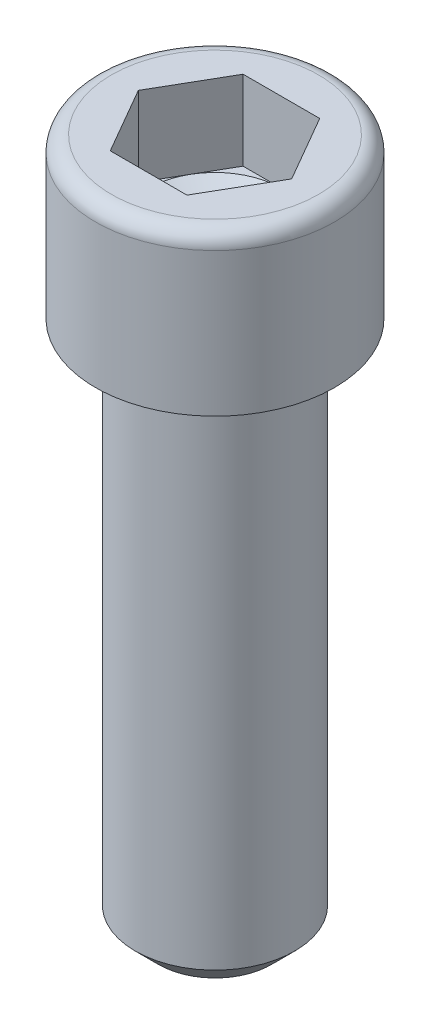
ISO-10303-21;
HEADER;
FILE_DESCRIPTION(('STEP AP214'),'2;1');
FILE_NAME('part.step','',(''),(''),'','','');
FILE_SCHEMA(('AUTOMOTIVE_DESIGN { 1 0 10303 214 1 1 1 1 }'));
ENDSEC;
DATA;
#1=APPLICATION_CONTEXT('core data for automotive mechanical design processes');
#2=APPLICATION_PROTOCOL_DEFINITION('international standard','automotive_design',2000,#1);
#3=PRODUCT_CONTEXT('',#1,'mechanical');
#4=PRODUCT('Part','Part','',(#3));
#5=PRODUCT_RELATED_PRODUCT_CATEGORY('part','',(#4));
#6=PRODUCT_DEFINITION_FORMATION('','',#4);
#7=PRODUCT_DEFINITION_CONTEXT('part definition',#1,'design');
#8=PRODUCT_DEFINITION('design','',#6,#7);
#9=PRODUCT_DEFINITION_SHAPE('','',#8);
#10=(LENGTH_UNIT() NAMED_UNIT(*) SI_UNIT(.MILLI.,.METRE.));
#11=(NAMED_UNIT(*) PLANE_ANGLE_UNIT() SI_UNIT($,.RADIAN.));
#12=(NAMED_UNIT(*) SI_UNIT($,.STERADIAN.) SOLID_ANGLE_UNIT());
#13=UNCERTAINTY_MEASURE_WITH_UNIT(LENGTH_MEASURE(1.E-05),#10,'distance_accuracy_value','');
#14=(GEOMETRIC_REPRESENTATION_CONTEXT(3) GLOBAL_UNCERTAINTY_ASSIGNED_CONTEXT((#13)) GLOBAL_UNIT_ASSIGNED_CONTEXT((#10,
#11,#12)) REPRESENTATION_CONTEXT('',''));
#15=CARTESIAN_POINT('',(0.,0.,0.));
#16=DIRECTION('',(0.,0.,1.));
#17=DIRECTION('',(1.,0.,0.));
#18=AXIS2_PLACEMENT_3D('',#15,#16,#17);
#19=CARTESIAN_POINT('',(5.,12.,0.));
#20=DIRECTION('',(0.,-1.,0.));
#21=DIRECTION('',(1.,0.,0.));
#22=AXIS2_PLACEMENT_3D('',#19,#20,#21);
#23=PLANE('',#22);
#24=CARTESIAN_POINT('',(0.,12.,0.));
#25=DIRECTION('',(0.,1.,0.));
#26=DIRECTION('',(-1.,0.,0.));
#27=AXIS2_PLACEMENT_3D('',#24,#25,#26);
#28=CIRCLE('',#27,7.8);
#29=CARTESIAN_POINT('',(-7.8,12.,0.));
#30=VERTEX_POINT('',#29);
#31=EDGE_CURVE('E139',#30,#30,#28,.T.);
#32=ORIENTED_EDGE('',*,*,#31,.T.);
#33=EDGE_LOOP('',(#32));
#34=FACE_BOUND('',#33,.T.);
#35=DIRECTION('',(0.499999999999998,0.,0.86602540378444));
#36=VECTOR('',#35,1.);
#37=CARTESIAN_POINT('',(2.88675134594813,12.,-5.));
#38=LINE('',#37,#36);
#39=CARTESIAN_POINT('',(2.88675134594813,12.,-5.));
#40=VERTEX_POINT('',#39);
#41=CARTESIAN_POINT('',(5.77350269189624,12.,0.));
#42=VERTEX_POINT('',#41);
#43=EDGE_CURVE('E371',#40,#42,#38,.T.);
#44=ORIENTED_EDGE('',*,*,#43,.T.);
#45=DIRECTION('',(-0.499999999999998,0.,0.86602540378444));
#46=VECTOR('',#45,1.);
#47=CARTESIAN_POINT('',(2.88675134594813,12.,5.));
#48=LINE('',#47,#46);
#49=CARTESIAN_POINT('',(2.88675134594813,12.,5.));
#50=VERTEX_POINT('',#49);
#51=EDGE_CURVE('E374',#42,#50,#48,.T.);
#52=ORIENTED_EDGE('',*,*,#51,.T.);
#53=DIRECTION('',(-1.,0.,0.));
#54=VECTOR('',#53,1.);
#55=CARTESIAN_POINT('',(2.88675134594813,12.,5.));
#56=LINE('',#55,#54);
#57=CARTESIAN_POINT('',(-2.88675134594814,12.,5.));
#58=VERTEX_POINT('',#57);
#59=EDGE_CURVE('E377',#50,#58,#56,.T.);
#60=ORIENTED_EDGE('',*,*,#59,.T.);
#61=DIRECTION('',(-0.499999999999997,0.,-0.86602540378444));
#62=VECTOR('',#61,1.);
#63=CARTESIAN_POINT('',(-2.88675134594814,12.,5.));
#64=LINE('',#63,#62);
#65=CARTESIAN_POINT('',(-5.77350269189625,12.,0.));
#66=VERTEX_POINT('',#65);
#67=EDGE_CURVE('E116',#58,#66,#64,.T.);
#68=ORIENTED_EDGE('',*,*,#67,.T.);
#69=DIRECTION('',(0.499999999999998,0.,-0.86602540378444));
#70=VECTOR('',#69,1.);
#71=CARTESIAN_POINT('',(-2.88675134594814,12.,-5.));
#72=LINE('',#71,#70);
#73=CARTESIAN_POINT('',(-2.88675134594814,12.,-5.));
#74=VERTEX_POINT('',#73);
#75=EDGE_CURVE('E368',#66,#74,#72,.T.);
#76=ORIENTED_EDGE('',*,*,#75,.T.);
#77=DIRECTION('',(1.,0.,0.));
#78=VECTOR('',#77,1.);
#79=CARTESIAN_POINT('',(2.88675134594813,12.,-5.));
#80=LINE('',#79,#78);
#81=EDGE_CURVE('E127',#74,#40,#80,.T.);
#82=ORIENTED_EDGE('',*,*,#81,.T.);
#83=EDGE_LOOP('',(#44,#52,#60,#68,#76,#82));
#84=FACE_BOUND('',#83,.T.);
#85=ADVANCED_FACE('F33',(#34,#84),#23,.F.);
#86=CARTESIAN_POINT('',(0.,-40.,0.));
#87=DIRECTION('',(0.,1.,0.));
#88=DIRECTION('',(0.,0.,1.));
#89=AXIS2_PLACEMENT_3D('',#86,#87,#88);
#90=CYLINDRICAL_SURFACE('',#89,6.);
#91=CARTESIAN_POINT('',(0.,-38.25,0.));
#92=DIRECTION('',(0.,1.,0.));
#93=DIRECTION('',(0.,0.,1.));
#94=AXIS2_PLACEMENT_3D('',#91,#92,#93);
#95=CIRCLE('',#94,6.);
#96=CARTESIAN_POINT('',(0.,-38.25,6.));
#97=VERTEX_POINT('',#96);
#98=EDGE_CURVE('E41',#97,#97,#95,.T.);
#99=ORIENTED_EDGE('',*,*,#98,.T.);
#100=EDGE_LOOP('',(#99));
#101=FACE_BOUND('',#100,.T.);
#102=CARTESIAN_POINT('',(0.,0.,0.));
#103=DIRECTION('',(0.,1.,0.));
#104=DIRECTION('',(0.,0.,1.));
#105=AXIS2_PLACEMENT_3D('',#102,#103,#104);
#106=CIRCLE('',#105,6.);
#107=CARTESIAN_POINT('',(0.,0.,6.));
#108=VERTEX_POINT('',#107);
#109=EDGE_CURVE('E149',#108,#108,#106,.T.);
#110=ORIENTED_EDGE('',*,*,#109,.F.);
#111=EDGE_LOOP('',(#110));
#112=FACE_BOUND('',#111,.T.);
#113=ADVANCED_FACE('F154',(#101,#112),#90,.T.);
#114=CARTESIAN_POINT('',(0.,-40.,0.));
#115=DIRECTION('',(0.,1.,0.));
#116=DIRECTION('',(0.,0.,1.));
#117=AXIS2_PLACEMENT_3D('',#114,#115,#116);
#118=PLANE('',#117);
#119=CARTESIAN_POINT('',(0.,-40.,0.));
#120=DIRECTION('',(0.,1.,0.));
#121=DIRECTION('',(0.,0.,1.));
#122=AXIS2_PLACEMENT_3D('',#119,#120,#121);
#123=CIRCLE('',#122,4.24999999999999);
#124=CARTESIAN_POINT('',(0.,-40.,4.24999999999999));
#125=VERTEX_POINT('',#124);
#126=EDGE_CURVE('E11',#125,#125,#123,.F.);
#127=ORIENTED_EDGE('',*,*,#126,.T.);
#128=EDGE_LOOP('',(#127));
#129=FACE_BOUND('',#128,.T.);
#130=ADVANCED_FACE('F159',(#129),#118,.F.);
#131=CARTESIAN_POINT('',(0.,-38.25,0.));
#132=DIRECTION('',(0.,1.,0.));
#133=DIRECTION('',(0.,0.,1.));
#134=AXIS2_PLACEMENT_3D('',#131,#132,#133);
#135=CONICAL_SURFACE('',#134,6.,0.78539816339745);
#136=CARTESIAN_POINT('',(0.,-40.,4.24999999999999));
#137=CARTESIAN_POINT('',(0.,-39.9817708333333,4.26822916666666));
#138=CARTESIAN_POINT('',(0.,-39.9635416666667,4.28645833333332));
#139=CARTESIAN_POINT('',(0.,-39.9270833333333,4.32291666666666));
#140=CARTESIAN_POINT('',(0.,-39.9088541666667,4.34114583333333));
#141=CARTESIAN_POINT('',(0.,-39.8723958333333,4.37760416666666));
#142=CARTESIAN_POINT('',(0.,-39.8541666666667,4.39583333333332));
#143=CARTESIAN_POINT('',(0.,-39.8177083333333,4.43229166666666));
#144=CARTESIAN_POINT('',(0.,-39.7994791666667,4.45052083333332));
#145=CARTESIAN_POINT('',(0.,-39.7630208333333,4.48697916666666));
#146=CARTESIAN_POINT('',(0.,-39.7447916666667,4.50520833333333));
#147=CARTESIAN_POINT('',(0.,-39.7083333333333,4.54166666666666));
#148=CARTESIAN_POINT('',(0.,-39.6901041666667,4.55989583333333));
#149=CARTESIAN_POINT('',(0.,-39.6536458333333,4.59635416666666));
#150=CARTESIAN_POINT('',(0.,-39.6354166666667,4.61458333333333));
#151=CARTESIAN_POINT('',(0.,-39.5989583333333,4.65104166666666));
#152=CARTESIAN_POINT('',(0.,-39.5807291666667,4.66927083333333));
#153=CARTESIAN_POINT('',(0.,-39.5442708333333,4.70572916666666));
#154=CARTESIAN_POINT('',(0.,-39.5260416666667,4.72395833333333));
#155=CARTESIAN_POINT('',(0.,-39.4895833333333,4.76041666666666));
#156=CARTESIAN_POINT('',(0.,-39.4713541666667,4.77864583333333));
#157=CARTESIAN_POINT('',(0.,-39.4348958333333,4.81510416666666));
#158=CARTESIAN_POINT('',(0.,-39.4166666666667,4.83333333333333));
#159=CARTESIAN_POINT('',(0.,-39.3802083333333,4.86979166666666));
#160=CARTESIAN_POINT('',(0.,-39.3619791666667,4.88802083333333));
#161=CARTESIAN_POINT('',(0.,-39.3255208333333,4.92447916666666));
#162=CARTESIAN_POINT('',(0.,-39.3072916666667,4.94270833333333));
#163=CARTESIAN_POINT('',(0.,-39.2708333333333,4.97916666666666));
#164=CARTESIAN_POINT('',(0.,-39.2526041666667,4.99739583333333));
#165=CARTESIAN_POINT('',(0.,-39.2161458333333,5.03385416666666));
#166=CARTESIAN_POINT('',(0.,-39.1979166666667,5.05208333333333));
#167=CARTESIAN_POINT('',(0.,-39.1614583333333,5.08854166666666));
#168=CARTESIAN_POINT('',(0.,-39.1432291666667,5.10677083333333));
#169=CARTESIAN_POINT('',(0.,-39.1067708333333,5.14322916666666));
#170=CARTESIAN_POINT('',(0.,-39.0885416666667,5.16145833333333));
#171=CARTESIAN_POINT('',(0.,-39.0520833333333,5.19791666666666));
#172=CARTESIAN_POINT('',(0.,-39.0338541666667,5.21614583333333));
#173=CARTESIAN_POINT('',(0.,-38.9973958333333,5.25260416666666));
#174=CARTESIAN_POINT('',(0.,-38.9791666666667,5.27083333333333));
#175=CARTESIAN_POINT('',(0.,-38.9427083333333,5.30729166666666));
#176=CARTESIAN_POINT('',(0.,-38.9244791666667,5.32552083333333));
#177=CARTESIAN_POINT('',(0.,-38.8880208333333,5.36197916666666));
#178=CARTESIAN_POINT('',(0.,-38.8697916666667,5.38020833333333));
#179=CARTESIAN_POINT('',(0.,-38.8333333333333,5.41666666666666));
#180=CARTESIAN_POINT('',(0.,-38.8151041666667,5.43489583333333));
#181=CARTESIAN_POINT('',(0.,-38.7786458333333,5.47135416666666));
#182=CARTESIAN_POINT('',(0.,-38.7604166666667,5.48958333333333));
#183=CARTESIAN_POINT('',(0.,-38.7239583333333,5.52604166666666));
#184=CARTESIAN_POINT('',(0.,-38.7057291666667,5.54427083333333));
#185=CARTESIAN_POINT('',(0.,-38.6692708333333,5.58072916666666));
#186=CARTESIAN_POINT('',(0.,-38.6510416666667,5.59895833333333));
#187=CARTESIAN_POINT('',(0.,-38.6145833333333,5.63541666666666));
#188=CARTESIAN_POINT('',(0.,-38.5963541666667,5.65364583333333));
#189=CARTESIAN_POINT('',(0.,-38.5598958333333,5.69010416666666));
#190=CARTESIAN_POINT('',(0.,-38.5416666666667,5.70833333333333));
#191=CARTESIAN_POINT('',(0.,-38.5052083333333,5.74479166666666));
#192=CARTESIAN_POINT('',(0.,-38.4869791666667,5.76302083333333));
#193=CARTESIAN_POINT('',(0.,-38.4505208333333,5.79947916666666));
#194=CARTESIAN_POINT('',(0.,-38.4322916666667,5.81770833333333));
#195=CARTESIAN_POINT('',(0.,-38.3958333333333,5.85416666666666));
#196=CARTESIAN_POINT('',(0.,-38.3776041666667,5.87239583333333));
#197=CARTESIAN_POINT('',(0.,-38.3411458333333,5.90885416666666));
#198=CARTESIAN_POINT('',(0.,-38.3229166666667,5.92708333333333));
#199=CARTESIAN_POINT('',(0.,-38.2864583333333,5.96354166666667));
#200=CARTESIAN_POINT('',(0.,-38.2682291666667,5.98177083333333));
#201=CARTESIAN_POINT('',(0.,-38.25,6.));
#202=B_SPLINE_CURVE_WITH_KNOTS('',3,(#136,#137,#138,#139,#140,#141,#142,#143,#144,#145,#146,
#147,#148,#149,#150,#151,#152,#153,#154,#155,#156,#157,#158,#159,#160,#161,#162,#163,#164,#165,
#166,#167,#168,#169,#170,#171,#172,#173,#174,#175,#176,#177,#178,#179,#180,#181,#182,#183,#184,
#185,#186,#187,#188,#189,#190,#191,#192,#193,#194,#195,#196,#197,#198,#199,#200,#201),
.UNSPECIFIED.,.F.,.F.,(4,2,2,2,2,2,2,2,2,2,2,2,2,2,2,2,2,2,2,2,2,2,2,2,2,2,2,2,2,2,2,2,4),(0.,
0.0773398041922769,0.154679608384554,0.232019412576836,0.309359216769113,0.38669902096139,
0.464038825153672,0.541378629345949,0.618718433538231,0.696058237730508,0.773398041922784,
0.850737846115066,0.928077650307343,1.00541745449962,1.0827572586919,1.16009706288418,
1.23743686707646,1.31477667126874,1.39211647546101,1.4694562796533,1.54679608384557,
1.62413588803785,1.70147569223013,1.77881549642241,1.85615530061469,1.93349510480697,
2.01083490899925,2.08817471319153,2.16551451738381,2.24285432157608,2.32019412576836,
2.39753392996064,2.47487373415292),.UNSPECIFIED.);
#203=EDGE_CURVE('BSEAM35',#125,#97,#202,.T.);
#204=ORIENTED_EDGE('',*,*,#126,.F.);
#205=ORIENTED_EDGE('',*,*,#98,.F.);
#206=ORIENTED_EDGE('',*,*,#203,.T.);
#207=ORIENTED_EDGE('',*,*,#203,.F.);
#208=EDGE_LOOP('',(#204,#206,#205,#207));
#209=FACE_BOUND('',#208,.T.);
#210=ADVANCED_FACE('F35',(#209),#135,.T.);
#211=CARTESIAN_POINT('',(0.,0.,0.));
#212=DIRECTION('',(0.,1.,0.));
#213=DIRECTION('',(-1.,0.,0.));
#214=AXIS2_PLACEMENT_3D('',#211,#212,#213);
#215=PLANE('',#214);
#216=ORIENTED_EDGE('',*,*,#109,.T.);
#217=EDGE_LOOP('',(#216));
#218=FACE_BOUND('',#217,.T.);
#219=CARTESIAN_POINT('',(0.,0.,0.));
#220=DIRECTION('',(0.,1.,0.));
#221=DIRECTION('',(-1.,0.,0.));
#222=AXIS2_PLACEMENT_3D('',#219,#220,#221);
#223=CIRCLE('',#222,9.);
#224=CARTESIAN_POINT('',(-9.,0.,0.));
#225=VERTEX_POINT('',#224);
#226=EDGE_CURVE('E146',#225,#225,#223,.T.);
#227=ORIENTED_EDGE('',*,*,#226,.F.);
#228=EDGE_LOOP('',(#227));
#229=FACE_BOUND('',#228,.T.);
#230=ADVANCED_FACE('F158',(#218,#229),#215,.F.);
#231=CARTESIAN_POINT('',(0.,12.,0.));
#232=DIRECTION('',(0.,1.,0.));
#233=DIRECTION('',(-1.,0.,0.));
#234=AXIS2_PLACEMENT_3D('',#231,#232,#233);
#235=CYLINDRICAL_SURFACE('',#234,9.);
#236=CARTESIAN_POINT('',(0.,10.8,0.));
#237=DIRECTION('',(0.,1.,0.));
#238=DIRECTION('',(-1.,0.,0.));
#239=AXIS2_PLACEMENT_3D('',#236,#237,#238);
#240=CIRCLE('',#239,9.);
#241=CARTESIAN_POINT('',(-9.,10.8,0.));
#242=VERTEX_POINT('',#241);
#243=EDGE_CURVE('E143',#242,#242,#240,.T.);
#244=ORIENTED_EDGE('',*,*,#243,.F.);
#245=EDGE_LOOP('',(#244));
#246=FACE_BOUND('',#245,.T.);
#247=ORIENTED_EDGE('',*,*,#226,.T.);
#248=EDGE_LOOP('',(#247));
#249=FACE_BOUND('',#248,.T.);
#250=ADVANCED_FACE('F165',(#246,#249),#235,.T.);
#251=CARTESIAN_POINT('',(0.,10.8,0.));
#252=DIRECTION('',(0.,1.,0.));
#253=DIRECTION('',(-1.,0.,0.));
#254=AXIS2_PLACEMENT_3D('',#251,#252,#253);
#255=TOROIDAL_SURFACE('',#254,7.8,1.2);
#256=ORIENTED_EDGE('',*,*,#31,.F.);
#257=EDGE_LOOP('',(#256));
#258=FACE_BOUND('',#257,.T.);
#259=ORIENTED_EDGE('',*,*,#243,.T.);
#260=EDGE_LOOP('',(#259));
#261=FACE_BOUND('',#260,.T.);
#262=ADVANCED_FACE('F182',(#258,#261),#255,.T.);
#263=CARTESIAN_POINT('',(-2.88675134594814,6.,-5.));
#264=DIRECTION('',(0.86602540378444,0.,0.499999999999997));
#265=DIRECTION('',(0.499999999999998,0.,-0.86602540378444));
#266=AXIS2_PLACEMENT_3D('',#263,#264,#265);
#267=PLANE('',#266);
#268=ORIENTED_EDGE('',*,*,#75,.F.);
#269=DIRECTION('',(0.,1.,0.));
#270=VECTOR('',#269,1.);
#271=CARTESIAN_POINT('',(-5.77350269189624,6.,0.));
#272=LINE('',#271,#270);
#273=CARTESIAN_POINT('',(-5.77350269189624,6.,0.));
#274=VERTEX_POINT('',#273);
#275=EDGE_CURVE('E363',#274,#66,#272,.T.);
#276=ORIENTED_EDGE('',*,*,#275,.F.);
#277=DIRECTION('',(0.499999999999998,0.,-0.86602540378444));
#278=VECTOR('',#277,1.);
#279=CARTESIAN_POINT('',(-2.88675134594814,6.,-5.));
#280=LINE('',#279,#278);
#281=CARTESIAN_POINT('',(-4.3301270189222,6.,-2.49999999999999));
#282=VERTEX_POINT('',#281);
#283=EDGE_CURVE('E112',#274,#282,#280,.T.);
#284=ORIENTED_EDGE('',*,*,#283,.T.);
#285=CARTESIAN_POINT('',(-2.88675134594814,6.,-5.));
#286=VERTEX_POINT('',#285);
#287=EDGE_CURVE('E106',#282,#286,#280,.T.);
#288=ORIENTED_EDGE('',*,*,#287,.T.);
#289=DIRECTION('',(0.,1.,0.));
#290=VECTOR('',#289,1.);
#291=CARTESIAN_POINT('',(-2.88675134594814,6.,-5.));
#292=LINE('',#291,#290);
#293=EDGE_CURVE('E108',#286,#74,#292,.T.);
#294=ORIENTED_EDGE('',*,*,#293,.T.);
#295=EDGE_LOOP('',(#268,#276,#284,#288,#294));
#296=FACE_BOUND('',#295,.T.);
#297=ADVANCED_FACE('F107',(#296),#267,.T.);
#298=CARTESIAN_POINT('',(2.88675134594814,6.,-5.));
#299=DIRECTION('',(0.,0.,1.));
#300=DIRECTION('',(1.,0.,0.));
#301=AXIS2_PLACEMENT_3D('',#298,#299,#300);
#302=PLANE('',#301);
#303=ORIENTED_EDGE('',*,*,#81,.F.);
#304=ORIENTED_EDGE('',*,*,#293,.F.);
#305=DIRECTION('',(1.,0.,0.));
#306=VECTOR('',#305,1.);
#307=CARTESIAN_POINT('',(2.88675134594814,6.,-5.));
#308=LINE('',#307,#306);
#309=CARTESIAN_POINT('',(0.,6.,-5.));
#310=VERTEX_POINT('',#309);
#311=EDGE_CURVE('E48',#286,#310,#308,.T.);
#312=ORIENTED_EDGE('',*,*,#311,.T.);
#313=CARTESIAN_POINT('',(2.88675134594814,6.,-5.));
#314=VERTEX_POINT('',#313);
#315=EDGE_CURVE('E122',#310,#314,#308,.T.);
#316=ORIENTED_EDGE('',*,*,#315,.T.);
#317=DIRECTION('',(0.,1.,0.));
#318=VECTOR('',#317,1.);
#319=CARTESIAN_POINT('',(2.88675134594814,6.,-5.));
#320=LINE('',#319,#318);
#321=EDGE_CURVE('E129',#314,#40,#320,.T.);
#322=ORIENTED_EDGE('',*,*,#321,.T.);
#323=EDGE_LOOP('',(#303,#304,#312,#316,#322));
#324=FACE_BOUND('',#323,.T.);
#325=ADVANCED_FACE('F124',(#324),#302,.T.);
#326=CARTESIAN_POINT('',(2.88675134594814,6.,-5.));
#327=DIRECTION('',(-0.86602540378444,0.,0.499999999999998));
#328=DIRECTION('',(0.499999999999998,0.,0.86602540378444));
#329=AXIS2_PLACEMENT_3D('',#326,#327,#328);
#330=PLANE('',#329);
#331=ORIENTED_EDGE('',*,*,#43,.F.);
#332=ORIENTED_EDGE('',*,*,#321,.F.);
#333=DIRECTION('',(0.499999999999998,0.,0.86602540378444));
#334=VECTOR('',#333,1.);
#335=CARTESIAN_POINT('',(2.88675134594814,6.,-5.));
#336=LINE('',#335,#334);
#337=CARTESIAN_POINT('',(4.3301270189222,6.,-2.49999999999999));
#338=VERTEX_POINT('',#337);
#339=EDGE_CURVE('E396',#314,#338,#336,.T.);
#340=ORIENTED_EDGE('',*,*,#339,.T.);
#341=CARTESIAN_POINT('',(5.77350269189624,6.,0.));
#342=VERTEX_POINT('',#341);
#343=EDGE_CURVE('E121',#338,#342,#336,.T.);
#344=ORIENTED_EDGE('',*,*,#343,.T.);
#345=DIRECTION('',(0.,1.,0.));
#346=VECTOR('',#345,1.);
#347=CARTESIAN_POINT('',(5.77350269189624,6.,0.));
#348=LINE('',#347,#346);
#349=EDGE_CURVE('E134',#342,#42,#348,.T.);
#350=ORIENTED_EDGE('',*,*,#349,.T.);
#351=EDGE_LOOP('',(#331,#332,#340,#344,#350));
#352=FACE_BOUND('',#351,.T.);
#353=ADVANCED_FACE('F212',(#352),#330,.T.);
#354=CARTESIAN_POINT('',(2.88675134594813,6.,5.));
#355=DIRECTION('',(-0.86602540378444,0.,-0.499999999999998));
#356=DIRECTION('',(-0.499999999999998,0.,0.86602540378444));
#357=AXIS2_PLACEMENT_3D('',#354,#355,#356);
#358=PLANE('',#357);
#359=ORIENTED_EDGE('',*,*,#51,.F.);
#360=ORIENTED_EDGE('',*,*,#349,.F.);
#361=DIRECTION('',(-0.499999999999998,0.,0.86602540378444));
#362=VECTOR('',#361,1.);
#363=CARTESIAN_POINT('',(2.88675134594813,6.,5.));
#364=LINE('',#363,#362);
#365=CARTESIAN_POINT('',(4.3301270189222,6.,2.49999999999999));
#366=VERTEX_POINT('',#365);
#367=EDGE_CURVE('E394',#342,#366,#364,.T.);
#368=ORIENTED_EDGE('',*,*,#367,.T.);
#369=CARTESIAN_POINT('',(2.88675134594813,6.,5.));
#370=VERTEX_POINT('',#369);
#371=EDGE_CURVE('E395',#366,#370,#364,.T.);
#372=ORIENTED_EDGE('',*,*,#371,.T.);
#373=DIRECTION('',(0.,1.,0.));
#374=VECTOR('',#373,1.);
#375=CARTESIAN_POINT('',(2.88675134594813,6.,5.));
#376=LINE('',#375,#374);
#377=EDGE_CURVE('E383',#370,#50,#376,.T.);
#378=ORIENTED_EDGE('',*,*,#377,.T.);
#379=EDGE_LOOP('',(#359,#360,#368,#372,#378));
#380=FACE_BOUND('',#379,.T.);
#381=ADVANCED_FACE('F219',(#380),#358,.T.);
#382=CARTESIAN_POINT('',(2.88675134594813,6.,5.));
#383=DIRECTION('',(0.,0.,-1.));
#384=DIRECTION('',(-1.,0.,0.));
#385=AXIS2_PLACEMENT_3D('',#382,#383,#384);
#386=PLANE('',#385);
#387=ORIENTED_EDGE('',*,*,#59,.F.);
#388=ORIENTED_EDGE('',*,*,#377,.F.);
#389=DIRECTION('',(-1.,0.,0.));
#390=VECTOR('',#389,1.);
#391=CARTESIAN_POINT('',(2.88675134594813,6.,5.));
#392=LINE('',#391,#390);
#393=CARTESIAN_POINT('',(0.,6.,5.));
#394=VERTEX_POINT('',#393);
#395=EDGE_CURVE('E358',#370,#394,#392,.T.);
#396=ORIENTED_EDGE('',*,*,#395,.T.);
#397=CARTESIAN_POINT('',(-2.88675134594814,6.,5.));
#398=VERTEX_POINT('',#397);
#399=EDGE_CURVE('E354',#394,#398,#392,.T.);
#400=ORIENTED_EDGE('',*,*,#399,.T.);
#401=DIRECTION('',(0.,1.,0.));
#402=VECTOR('',#401,1.);
#403=CARTESIAN_POINT('',(-2.88675134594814,6.,5.));
#404=LINE('',#403,#402);
#405=EDGE_CURVE('E362',#398,#58,#404,.T.);
#406=ORIENTED_EDGE('',*,*,#405,.T.);
#407=EDGE_LOOP('',(#387,#388,#396,#400,#406));
#408=FACE_BOUND('',#407,.T.);
#409=ADVANCED_FACE('F227',(#408),#386,.T.);
#410=CARTESIAN_POINT('',(-2.88675134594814,6.,5.));
#411=DIRECTION('',(0.86602540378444,0.,-0.499999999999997));
#412=DIRECTION('',(-0.499999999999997,0.,-0.86602540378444));
#413=AXIS2_PLACEMENT_3D('',#410,#411,#412);
#414=PLANE('',#413);
#415=ORIENTED_EDGE('',*,*,#67,.F.);
#416=ORIENTED_EDGE('',*,*,#405,.F.);
#417=DIRECTION('',(-0.499999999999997,0.,-0.86602540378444));
#418=VECTOR('',#417,1.);
#419=CARTESIAN_POINT('',(-2.88675134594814,6.,5.));
#420=LINE('',#419,#418);
#421=CARTESIAN_POINT('',(-4.3301270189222,6.,2.49999999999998));
#422=VERTEX_POINT('',#421);
#423=EDGE_CURVE('E353',#398,#422,#420,.T.);
#424=ORIENTED_EDGE('',*,*,#423,.T.);
#425=EDGE_CURVE('E356',#422,#274,#420,.T.);
#426=ORIENTED_EDGE('',*,*,#425,.T.);
#427=ORIENTED_EDGE('',*,*,#275,.T.);
#428=EDGE_LOOP('',(#415,#416,#424,#426,#427));
#429=FACE_BOUND('',#428,.T.);
#430=ADVANCED_FACE('F235',(#429),#414,.T.);
#431=CARTESIAN_POINT('',(-8.66025403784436,6.,5.));
#432=DIRECTION('',(0.,-1.,0.));
#433=DIRECTION('',(0.,0.,-1.));
#434=AXIS2_PLACEMENT_3D('',#431,#432,#433);
#435=PLANE('',#434);
#436=ORIENTED_EDGE('',*,*,#311,.F.);
#437=ORIENTED_EDGE('',*,*,#287,.F.);
#438=CARTESIAN_POINT('',(0.,6.,0.));
#439=DIRECTION('',(0.,1.,0.));
#440=DIRECTION('',(-1.,0.,0.));
#441=AXIS2_PLACEMENT_3D('',#438,#439,#440);
#442=CIRCLE('',#441,5.);
#443=EDGE_CURVE('E119',#310,#282,#442,.T.);
#444=ORIENTED_EDGE('',*,*,#443,.F.);
#445=EDGE_LOOP('',(#436,#437,#444));
#446=FACE_BOUND('',#445,.T.);
#447=ADVANCED_FACE('F118',(#446),#435,.F.);
#448=ORIENTED_EDGE('',*,*,#283,.F.);
#449=ORIENTED_EDGE('',*,*,#425,.F.);
#450=EDGE_CURVE('E128',#282,#422,#442,.T.);
#451=ORIENTED_EDGE('',*,*,#450,.F.);
#452=EDGE_LOOP('',(#448,#449,#451));
#453=FACE_BOUND('',#452,.T.);
#454=ADVANCED_FACE('F250',(#453),#435,.F.);
#455=ORIENTED_EDGE('',*,*,#423,.F.);
#456=ORIENTED_EDGE('',*,*,#399,.F.);
#457=EDGE_CURVE('E133',#422,#394,#442,.T.);
#458=ORIENTED_EDGE('',*,*,#457,.F.);
#459=EDGE_LOOP('',(#455,#456,#458));
#460=FACE_BOUND('',#459,.T.);
#461=ADVANCED_FACE('F258',(#460),#435,.F.);
#462=ORIENTED_EDGE('',*,*,#395,.F.);
#463=ORIENTED_EDGE('',*,*,#371,.F.);
#464=EDGE_CURVE('E140',#394,#366,#442,.T.);
#465=ORIENTED_EDGE('',*,*,#464,.F.);
#466=EDGE_LOOP('',(#462,#463,#465));
#467=FACE_BOUND('',#466,.T.);
#468=ADVANCED_FACE('F265',(#467),#435,.F.);
#469=ORIENTED_EDGE('',*,*,#367,.F.);
#470=ORIENTED_EDGE('',*,*,#343,.F.);
#471=EDGE_CURVE('E400',#366,#338,#442,.T.);
#472=ORIENTED_EDGE('',*,*,#471,.F.);
#473=EDGE_LOOP('',(#469,#470,#472));
#474=FACE_BOUND('',#473,.T.);
#475=ADVANCED_FACE('F272',(#474),#435,.F.);
#476=ORIENTED_EDGE('',*,*,#339,.F.);
#477=ORIENTED_EDGE('',*,*,#315,.F.);
#478=EDGE_CURVE('E399',#338,#310,#442,.T.);
#479=ORIENTED_EDGE('',*,*,#478,.F.);
#480=EDGE_LOOP('',(#476,#477,#479));
#481=FACE_BOUND('',#480,.T.);
#482=ADVANCED_FACE('F252',(#481),#435,.F.);
#483=CARTESIAN_POINT('',(0.,6.,0.));
#484=DIRECTION('',(0.,1.,0.));
#485=DIRECTION('',(-1.,0.,0.));
#486=AXIS2_PLACEMENT_3D('',#483,#484,#485);
#487=CONICAL_SURFACE('',#486,5.,1.04719755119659);
#488=CARTESIAN_POINT('',(0.,3.11324865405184,0.));
#489=VERTEX_POINT('',#488);
#490=VERTEX_LOOP('',#489);
#491=FACE_BOUND('',#490,.T.);
#492=ORIENTED_EDGE('',*,*,#457,.T.);
#493=ORIENTED_EDGE('',*,*,#464,.T.);
#494=ORIENTED_EDGE('',*,*,#471,.T.);
#495=ORIENTED_EDGE('',*,*,#478,.T.);
#496=ORIENTED_EDGE('',*,*,#443,.T.);
#497=ORIENTED_EDGE('',*,*,#450,.T.);
#498=EDGE_LOOP('',(#492,#493,#494,#495,#496,#497));
#499=FACE_BOUND('',#498,.T.);
#500=ADVANCED_FACE('F180',(#491,#499),#487,.F.);
#501=CLOSED_SHELL('',(#85,#113,#130,#210,#230,#250,#262,#297,#325,#353,#381,#409,#430,#447,#454,
#461,#468,#475,#482,#500));
#502=MANIFOLD_SOLID_BREP('B2',#501);
#503=ADVANCED_BREP_SHAPE_REPRESENTATION('',(#18,#502),#14);
#504=SHAPE_DEFINITION_REPRESENTATION(#9,#503);
ENDSEC;
END-ISO-10303-21;
